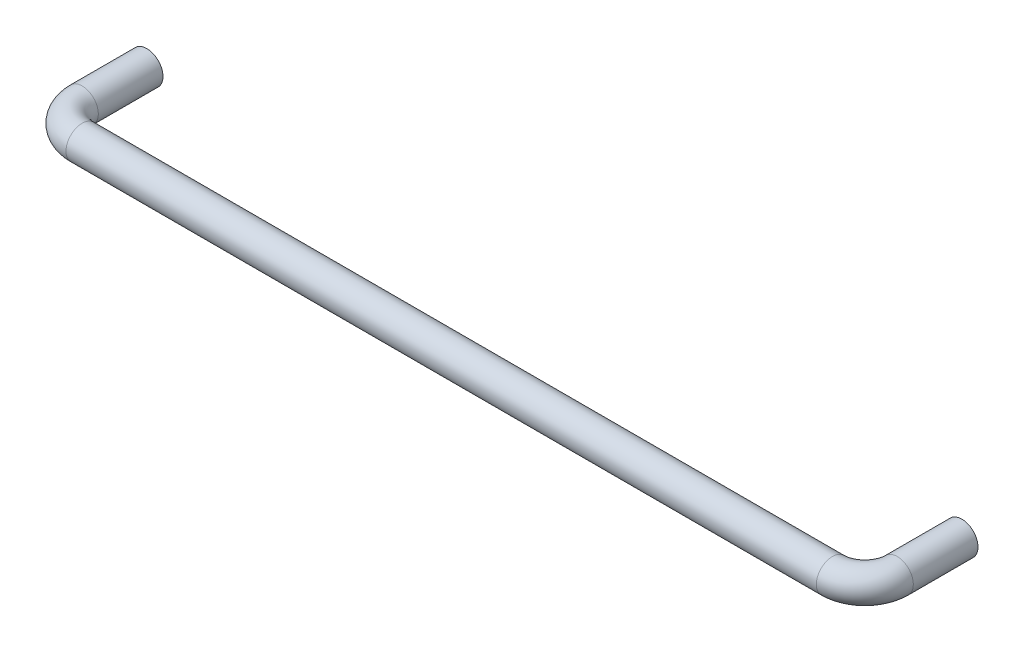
ISO-10303-21;
HEADER;
FILE_DESCRIPTION(('STEP AP214'),'2;1');
FILE_NAME('part.step','',(''),(''),'','','');
FILE_SCHEMA(('AUTOMOTIVE_DESIGN { 1 0 10303 214 1 1 1 1 }'));
ENDSEC;
DATA;
#1=APPLICATION_CONTEXT('core data for automotive mechanical design processes');
#2=APPLICATION_PROTOCOL_DEFINITION('international standard','automotive_design',2000,#1);
#3=PRODUCT_CONTEXT('',#1,'mechanical');
#4=PRODUCT('Part','Part','',(#3));
#5=PRODUCT_RELATED_PRODUCT_CATEGORY('part','',(#4));
#6=PRODUCT_DEFINITION_FORMATION('','',#4);
#7=PRODUCT_DEFINITION_CONTEXT('part definition',#1,'design');
#8=PRODUCT_DEFINITION('design','',#6,#7);
#9=PRODUCT_DEFINITION_SHAPE('','',#8);
#10=(LENGTH_UNIT() NAMED_UNIT(*) SI_UNIT(.MILLI.,.METRE.));
#11=(NAMED_UNIT(*) PLANE_ANGLE_UNIT() SI_UNIT($,.RADIAN.));
#12=(NAMED_UNIT(*) SI_UNIT($,.STERADIAN.) SOLID_ANGLE_UNIT());
#13=UNCERTAINTY_MEASURE_WITH_UNIT(LENGTH_MEASURE(1.E-05),#10,'distance_accuracy_value','');
#14=(GEOMETRIC_REPRESENTATION_CONTEXT(3) GLOBAL_UNCERTAINTY_ASSIGNED_CONTEXT((#13)) GLOBAL_UNIT_ASSIGNED_CONTEXT((#10,
#11,#12)) REPRESENTATION_CONTEXT('',''));
#15=CARTESIAN_POINT('',(0.,0.,0.));
#16=DIRECTION('',(0.,0.,1.));
#17=DIRECTION('',(1.,0.,0.));
#18=AXIS2_PLACEMENT_3D('',#15,#16,#17);
#19=CARTESIAN_POINT('',(9.99999999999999,0.,30.));
#20=DIRECTION('',(1.,0.,0.));
#21=DIRECTION('',(0.,1.,0.));
#22=AXIS2_PLACEMENT_3D('',#19,#20,#21);
#23=CYLINDRICAL_SURFACE('',#22,5.);
#24=CARTESIAN_POINT('',(9.99999999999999,0.,30.));
#25=DIRECTION('',(1.,0.,0.));
#26=DIRECTION('',(0.,0.,-1.));
#27=AXIS2_PLACEMENT_3D('',#24,#25,#26);
#28=CIRCLE('',#27,5.);
#29=CARTESIAN_POINT('',(9.99999999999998,0.,35.));
#30=VERTEX_POINT('',#29);
#31=EDGE_CURVE('E11',#30,#30,#28,.T.);
#32=ORIENTED_EDGE('',*,*,#31,.T.);
#33=EDGE_LOOP('',(#32));
#34=FACE_BOUND('',#33,.T.);
#35=CARTESIAN_POINT('',(242.,0.,30.0000000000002));
#36=DIRECTION('',(1.,0.,0.));
#37=DIRECTION('',(0.,0.,-1.));
#38=AXIS2_PLACEMENT_3D('',#35,#36,#37);
#39=CIRCLE('',#38,5.);
#40=CARTESIAN_POINT('',(242.,0.,35.0000000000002));
#41=VERTEX_POINT('',#40);
#42=EDGE_CURVE('E61',#41,#41,#39,.T.);
#43=ORIENTED_EDGE('',*,*,#42,.F.);
#44=EDGE_LOOP('',(#43));
#45=FACE_BOUND('',#44,.T.);
#46=ADVANCED_FACE('F28',(#34,#45),#23,.T.);
#47=CARTESIAN_POINT('',(10.,0.,20.));
#48=DIRECTION('',(0.,1.,0.));
#49=DIRECTION('',(0.,0.,1.));
#50=AXIS2_PLACEMENT_3D('',#47,#48,#49);
#51=TOROIDAL_SURFACE('',#50,10.,5.);
#52=CARTESIAN_POINT('',(0.,0.,20.));
#53=DIRECTION('',(0.,0.,1.));
#54=DIRECTION('',(1.,0.,0.));
#55=AXIS2_PLACEMENT_3D('',#52,#53,#54);
#56=CIRCLE('',#55,5.);
#57=CARTESIAN_POINT('',(-5.,0.,20.));
#58=VERTEX_POINT('',#57);
#59=EDGE_CURVE('E35',#58,#58,#56,.T.);
#60=CARTESIAN_POINT('',(10.,0.,20.));
#61=DIRECTION('',(0.,1.,0.));
#62=DIRECTION('',(0.,0.,1.));
#63=AXIS2_PLACEMENT_3D('',#60,#61,#62);
#64=CIRCLE('',#63,15.);
#65=EDGE_CURVE('',#58,#30,#64,.T.);
#66=ORIENTED_EDGE('',*,*,#59,.T.);
#67=ORIENTED_EDGE('',*,*,#31,.F.);
#68=ORIENTED_EDGE('',*,*,#65,.T.);
#69=ORIENTED_EDGE('',*,*,#65,.F.);
#70=EDGE_LOOP('',(#66,#68,#67,#69));
#71=FACE_BOUND('',#70,.T.);
#72=ADVANCED_FACE('F75',(#71),#51,.T.);
#73=CARTESIAN_POINT('',(0.,0.,20.));
#74=DIRECTION('',(0.,0.,-1.));
#75=DIRECTION('',(-1.,0.,0.));
#76=AXIS2_PLACEMENT_3D('',#73,#74,#75);
#77=CYLINDRICAL_SURFACE('',#76,5.);
#78=ORIENTED_EDGE('',*,*,#59,.F.);
#79=EDGE_LOOP('',(#78));
#80=FACE_BOUND('',#79,.T.);
#81=CARTESIAN_POINT('',(0.,0.,0.));
#82=DIRECTION('',(0.,0.,1.));
#83=DIRECTION('',(1.,0.,0.));
#84=AXIS2_PLACEMENT_3D('',#81,#82,#83);
#85=CIRCLE('',#84,5.);
#86=CARTESIAN_POINT('',(5.,0.,0.));
#87=VERTEX_POINT('',#86);
#88=EDGE_CURVE('E70',#87,#87,#85,.T.);
#89=ORIENTED_EDGE('',*,*,#88,.T.);
#90=EDGE_LOOP('',(#89));
#91=FACE_BOUND('',#90,.T.);
#92=ADVANCED_FACE('F78',(#80,#91),#77,.T.);
#93=CARTESIAN_POINT('',(0.,0.,0.));
#94=DIRECTION('',(0.,0.,1.));
#95=DIRECTION('',(1.,0.,0.));
#96=AXIS2_PLACEMENT_3D('',#93,#94,#95);
#97=PLANE('',#96);
#98=CARTESIAN_POINT('',(0.,0.,0.));
#99=DIRECTION('',(0.,0.,-1.));
#100=DIRECTION('',(-1.,0.,0.));
#101=AXIS2_PLACEMENT_3D('',#98,#99,#100);
#102=CIRCLE('',#101,1.5);
#103=CARTESIAN_POINT('',(-1.5,0.,0.));
#104=VERTEX_POINT('',#103);
#105=EDGE_CURVE('E67',#104,#104,#102,.T.);
#106=ORIENTED_EDGE('',*,*,#105,.F.);
#107=EDGE_LOOP('',(#106));
#108=FACE_BOUND('',#107,.T.);
#109=ORIENTED_EDGE('',*,*,#88,.F.);
#110=EDGE_LOOP('',(#109));
#111=FACE_BOUND('',#110,.T.);
#112=ADVANCED_FACE('F81',(#108,#111),#97,.F.);
#113=CARTESIAN_POINT('',(0.,0.,0.));
#114=DIRECTION('',(0.,0.,-1.));
#115=DIRECTION('',(-1.,0.,0.));
#116=AXIS2_PLACEMENT_3D('',#113,#114,#115);
#117=CYLINDRICAL_SURFACE('',#116,1.5);
#118=CARTESIAN_POINT('',(0.,0.,3.));
#119=DIRECTION('',(0.,0.,-1.));
#120=DIRECTION('',(-1.,0.,0.));
#121=AXIS2_PLACEMENT_3D('',#118,#119,#120);
#122=CIRCLE('',#121,1.5);
#123=CARTESIAN_POINT('',(-1.5,0.,3.));
#124=VERTEX_POINT('',#123);
#125=EDGE_CURVE('E64',#124,#124,#122,.T.);
#126=ORIENTED_EDGE('',*,*,#125,.F.);
#127=EDGE_LOOP('',(#126));
#128=FACE_BOUND('',#127,.T.);
#129=ORIENTED_EDGE('',*,*,#105,.T.);
#130=EDGE_LOOP('',(#129));
#131=FACE_BOUND('',#130,.T.);
#132=ADVANCED_FACE('F86',(#128,#131),#117,.F.);
#133=CARTESIAN_POINT('',(0.,0.,3.));
#134=DIRECTION('',(0.,0.,-1.));
#135=DIRECTION('',(-1.,0.,0.));
#136=AXIS2_PLACEMENT_3D('',#133,#134,#135);
#137=CONICAL_SURFACE('',#136,1.5,1.02974425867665);
#138=CARTESIAN_POINT('',(0.,0.,3.90129092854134));
#139=VERTEX_POINT('',#138);
#140=VERTEX_LOOP('',#139);
#141=FACE_BOUND('',#140,.T.);
#142=ORIENTED_EDGE('',*,*,#125,.T.);
#143=EDGE_LOOP('',(#142));
#144=FACE_BOUND('',#143,.T.);
#145=ADVANCED_FACE('F94',(#141,#144),#137,.F.);
#146=CARTESIAN_POINT('',(242.,0.,20.0000000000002));
#147=DIRECTION('',(0.,1.,0.));
#148=DIRECTION('',(0.,0.,1.));
#149=AXIS2_PLACEMENT_3D('',#146,#147,#148);
#150=TOROIDAL_SURFACE('',#149,10.,5.);
#151=CARTESIAN_POINT('',(252.,0.,20.0000000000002));
#152=DIRECTION('',(0.,0.,-1.));
#153=DIRECTION('',(-1.,0.,0.));
#154=AXIS2_PLACEMENT_3D('',#151,#152,#153);
#155=CIRCLE('',#154,5.);
#156=CARTESIAN_POINT('',(257.,0.,20.0000000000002));
#157=VERTEX_POINT('',#156);
#158=EDGE_CURVE('E58',#157,#157,#155,.T.);
#159=CARTESIAN_POINT('',(242.,0.,20.0000000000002));
#160=DIRECTION('',(0.,1.,0.));
#161=DIRECTION('',(0.,0.,1.));
#162=AXIS2_PLACEMENT_3D('',#159,#160,#161);
#163=CIRCLE('',#162,15.);
#164=EDGE_CURVE('',#41,#157,#163,.T.);
#165=ORIENTED_EDGE('',*,*,#42,.T.);
#166=ORIENTED_EDGE('',*,*,#158,.F.);
#167=ORIENTED_EDGE('',*,*,#164,.T.);
#168=ORIENTED_EDGE('',*,*,#164,.F.);
#169=EDGE_LOOP('',(#165,#167,#166,#168));
#170=FACE_BOUND('',#169,.T.);
#171=ADVANCED_FACE('F109',(#170),#150,.T.);
#172=CARTESIAN_POINT('',(252.,0.,20.0000000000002));
#173=DIRECTION('',(0.,0.,-1.));
#174=DIRECTION('',(1.,0.,0.));
#175=AXIS2_PLACEMENT_3D('',#172,#173,#174);
#176=CYLINDRICAL_SURFACE('',#175,5.);
#177=ORIENTED_EDGE('',*,*,#158,.T.);
#178=EDGE_LOOP('',(#177));
#179=FACE_BOUND('',#178,.T.);
#180=CARTESIAN_POINT('',(252.,0.,2.39251511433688E-13));
#181=DIRECTION('',(0.,0.,-1.));
#182=DIRECTION('',(-1.,0.,0.));
#183=AXIS2_PLACEMENT_3D('',#180,#181,#182);
#184=CIRCLE('',#183,5.);
#185=CARTESIAN_POINT('',(247.,0.,2.29757403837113E-13));
#186=VERTEX_POINT('',#185);
#187=EDGE_CURVE('E53',#186,#186,#184,.T.);
#188=ORIENTED_EDGE('',*,*,#187,.F.);
#189=EDGE_LOOP('',(#188));
#190=FACE_BOUND('',#189,.T.);
#191=ADVANCED_FACE('F110',(#179,#190),#176,.T.);
#192=CARTESIAN_POINT('',(252.,0.,2.39251511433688E-13));
#193=DIRECTION('',(0.,0.,1.));
#194=DIRECTION('',(-1.,0.,0.));
#195=AXIS2_PLACEMENT_3D('',#192,#193,#194);
#196=PLANE('',#195);
#197=CARTESIAN_POINT('',(252.,0.,2.39312741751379E-13));
#198=DIRECTION('',(0.,0.,1.));
#199=DIRECTION('',(1.,0.,0.));
#200=AXIS2_PLACEMENT_3D('',#197,#198,#199);
#201=CIRCLE('',#200,1.5);
#202=CARTESIAN_POINT('',(253.5,0.,2.42160974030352E-13));
#203=VERTEX_POINT('',#202);
#204=EDGE_CURVE('E50',#203,#203,#201,.T.);
#205=ORIENTED_EDGE('',*,*,#204,.T.);
#206=EDGE_LOOP('',(#205));
#207=FACE_BOUND('',#206,.T.);
#208=ORIENTED_EDGE('',*,*,#187,.T.);
#209=EDGE_LOOP('',(#208));
#210=FACE_BOUND('',#209,.T.);
#211=ADVANCED_FACE('F116',(#207,#210),#196,.F.);
#212=CARTESIAN_POINT('',(252.,0.,2.39251511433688E-13));
#213=DIRECTION('',(0.,0.,-1.));
#214=DIRECTION('',(1.,0.,0.));
#215=AXIS2_PLACEMENT_3D('',#212,#213,#214);
#216=CYLINDRICAL_SURFACE('',#215,1.5);
#217=CARTESIAN_POINT('',(252.,0.,3.00000000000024));
#218=DIRECTION('',(0.,0.,1.));
#219=DIRECTION('',(1.,0.,0.));
#220=AXIS2_PLACEMENT_3D('',#217,#218,#219);
#221=CIRCLE('',#220,1.5);
#222=CARTESIAN_POINT('',(253.5,0.,3.00000000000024));
#223=VERTEX_POINT('',#222);
#224=EDGE_CURVE('E48',#223,#223,#221,.T.);
#225=ORIENTED_EDGE('',*,*,#224,.T.);
#226=EDGE_LOOP('',(#225));
#227=FACE_BOUND('',#226,.T.);
#228=ORIENTED_EDGE('',*,*,#204,.F.);
#229=EDGE_LOOP('',(#228));
#230=FACE_BOUND('',#229,.T.);
#231=ADVANCED_FACE('F44',(#227,#230),#216,.F.);
#232=CARTESIAN_POINT('',(252.,0.,3.00000000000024));
#233=DIRECTION('',(0.,0.,-1.));
#234=DIRECTION('',(1.,0.,0.));
#235=AXIS2_PLACEMENT_3D('',#232,#233,#234);
#236=CONICAL_SURFACE('',#235,1.5,1.02974425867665);
#237=CARTESIAN_POINT('',(252.,0.,3.90129092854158));
#238=VERTEX_POINT('',#237);
#239=VERTEX_LOOP('',#238);
#240=FACE_BOUND('',#239,.T.);
#241=ORIENTED_EDGE('',*,*,#224,.F.);
#242=EDGE_LOOP('',(#241));
#243=FACE_BOUND('',#242,.T.);
#244=ADVANCED_FACE('F41',(#240,#243),#236,.F.);
#245=CLOSED_SHELL('',(#46,#72,#92,#112,#132,#145,#171,#191,#211,#231,#244));
#246=MANIFOLD_SOLID_BREP('B2',#245);
#247=ADVANCED_BREP_SHAPE_REPRESENTATION('',(#18,#246),#14);
#248=SHAPE_DEFINITION_REPRESENTATION(#9,#247);
ENDSEC;
END-ISO-10303-21;
